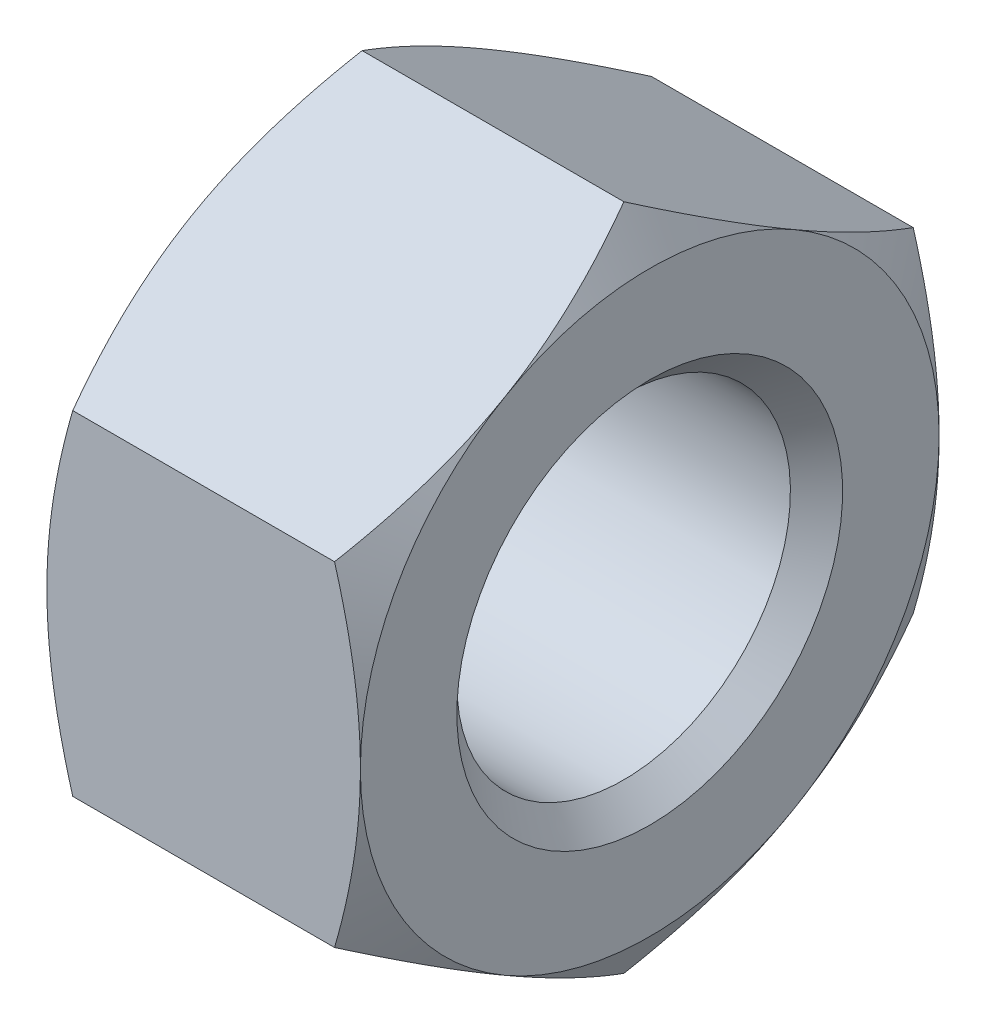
ISO-10303-21;
HEADER;
FILE_DESCRIPTION(('STEP AP214'),'2;1');
FILE_NAME('part.step','',(''),(''),'','','');
FILE_SCHEMA(('AUTOMOTIVE_DESIGN { 1 0 10303 214 1 1 1 1 }'));
ENDSEC;
DATA;
#1=APPLICATION_CONTEXT('core data for automotive mechanical design processes');
#2=APPLICATION_PROTOCOL_DEFINITION('international standard','automotive_design',2000,#1);
#3=PRODUCT_CONTEXT('',#1,'mechanical');
#4=PRODUCT('Part','Part','',(#3));
#5=PRODUCT_RELATED_PRODUCT_CATEGORY('part','',(#4));
#6=PRODUCT_DEFINITION_FORMATION('','',#4);
#7=PRODUCT_DEFINITION_CONTEXT('part definition',#1,'design');
#8=PRODUCT_DEFINITION('design','',#6,#7);
#9=PRODUCT_DEFINITION_SHAPE('','',#8);
#10=(LENGTH_UNIT() NAMED_UNIT(*) SI_UNIT(.MILLI.,.METRE.));
#11=(NAMED_UNIT(*) PLANE_ANGLE_UNIT() SI_UNIT($,.RADIAN.));
#12=(NAMED_UNIT(*) SI_UNIT($,.STERADIAN.) SOLID_ANGLE_UNIT());
#13=UNCERTAINTY_MEASURE_WITH_UNIT(LENGTH_MEASURE(1.E-05),#10,'distance_accuracy_value','');
#14=(GEOMETRIC_REPRESENTATION_CONTEXT(3) GLOBAL_UNCERTAINTY_ASSIGNED_CONTEXT((#13)) GLOBAL_UNIT_ASSIGNED_CONTEXT((#10,
#11,#12)) REPRESENTATION_CONTEXT('',''));
#15=CARTESIAN_POINT('',(0.,0.,0.));
#16=DIRECTION('',(0.,0.,1.));
#17=DIRECTION('',(1.,0.,0.));
#18=AXIS2_PLACEMENT_3D('',#15,#16,#17);
#19=DIRECTION('',(-0.707106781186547,0.707106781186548,0.));
#20=VECTOR('',#19,1.);
#21=CARTESIAN_POINT('',(0.54125,7.45875,0.));
#22=LINE('',#21,#20);
#23=CARTESIAN_POINT('',(8.,0.,0.));
#24=DIRECTION('',(-1.,0.,0.));
#25=AXIS1_PLACEMENT('',#23,#24);
#26=SURFACE_OF_REVOLUTION('',#22,#25);
#27=CARTESIAN_POINT('',(1.0825,0.,0.));
#28=DIRECTION('',(-1.,0.,0.));
#29=DIRECTION('',(0.,1.,0.));
#30=AXIS2_PLACEMENT_3D('',#27,#28,#29);
#31=CIRCLE('',#30,6.9175);
#32=CARTESIAN_POINT('',(1.0825,6.9175,0.));
#33=VERTEX_POINT('',#32);
#34=EDGE_CURVE('E323',#33,#33,#31,.T.);
#35=ORIENTED_EDGE('',*,*,#34,.F.);
#36=EDGE_LOOP('',(#35));
#37=FACE_BOUND('',#36,.T.);
#38=CARTESIAN_POINT('',(0.,0.,0.));
#39=DIRECTION('',(-1.,0.,0.));
#40=DIRECTION('',(0.,1.,0.));
#41=AXIS2_PLACEMENT_3D('',#38,#39,#40);
#42=CIRCLE('',#41,8.);
#43=CARTESIAN_POINT('',(0.,8.,0.));
#44=VERTEX_POINT('',#43);
#45=EDGE_CURVE('E136',#44,#44,#42,.T.);
#46=ORIENTED_EDGE('',*,*,#45,.T.);
#47=EDGE_LOOP('',(#46));
#48=FACE_BOUND('',#47,.T.);
#49=ADVANCED_FACE('F17',(#37,#48),#26,.F.);
#50=CARTESIAN_POINT('',(0.,10.,0.));
#51=DIRECTION('',(-1.,0.,0.));
#52=DIRECTION('',(0.,-1.,0.));
#53=AXIS2_PLACEMENT_3D('',#50,#51,#52);
#54=PLANE('',#53);
#55=CARTESIAN_POINT('',(0.,0.,0.));
#56=DIRECTION('',(-1.,0.,0.));
#57=DIRECTION('',(0.,1.,0.));
#58=AXIS2_PLACEMENT_3D('',#55,#56,#57);
#59=CIRCLE('',#58,12.);
#60=CARTESIAN_POINT('',(0.,10.3923048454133,6.));
#61=VERTEX_POINT('',#60);
#62=CARTESIAN_POINT('',(0.,10.3923048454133,-6.));
#63=VERTEX_POINT('',#62);
#64=EDGE_CURVE('E11',#61,#63,#59,.T.);
#65=ORIENTED_EDGE('',*,*,#64,.T.);
#66=CARTESIAN_POINT('',(0.,0.,0.));
#67=DIRECTION('',(-1.,0.,0.));
#68=DIRECTION('',(0.,1.,0.));
#69=AXIS2_PLACEMENT_3D('',#66,#67,#68);
#70=CIRCLE('',#69,12.);
#71=CARTESIAN_POINT('',(0.,0.,-12.));
#72=VERTEX_POINT('',#71);
#73=EDGE_CURVE('E27',#63,#72,#70,.T.);
#74=ORIENTED_EDGE('',*,*,#73,.T.);
#75=CARTESIAN_POINT('',(0.,0.,0.));
#76=DIRECTION('',(-1.,0.,0.));
#77=DIRECTION('',(0.,1.,0.));
#78=AXIS2_PLACEMENT_3D('',#75,#76,#77);
#79=CIRCLE('',#78,12.);
#80=CARTESIAN_POINT('',(0.,-10.3923048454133,-6.));
#81=VERTEX_POINT('',#80);
#82=EDGE_CURVE('E147',#72,#81,#79,.T.);
#83=ORIENTED_EDGE('',*,*,#82,.T.);
#84=CARTESIAN_POINT('',(0.,0.,0.));
#85=DIRECTION('',(-1.,0.,0.));
#86=DIRECTION('',(0.,1.,0.));
#87=AXIS2_PLACEMENT_3D('',#84,#85,#86);
#88=CIRCLE('',#87,12.);
#89=CARTESIAN_POINT('',(0.,-10.3923048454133,6.));
#90=VERTEX_POINT('',#89);
#91=EDGE_CURVE('E144',#81,#90,#88,.T.);
#92=ORIENTED_EDGE('',*,*,#91,.T.);
#93=CARTESIAN_POINT('',(0.,0.,0.));
#94=DIRECTION('',(-1.,0.,0.));
#95=DIRECTION('',(0.,1.,0.));
#96=AXIS2_PLACEMENT_3D('',#93,#94,#95);
#97=CIRCLE('',#96,12.);
#98=CARTESIAN_POINT('',(0.,0.,12.));
#99=VERTEX_POINT('',#98);
#100=EDGE_CURVE('E148',#90,#99,#97,.T.);
#101=ORIENTED_EDGE('',*,*,#100,.T.);
#102=CARTESIAN_POINT('',(0.,0.,0.));
#103=DIRECTION('',(-1.,0.,0.));
#104=DIRECTION('',(0.,1.,0.));
#105=AXIS2_PLACEMENT_3D('',#102,#103,#104);
#106=CIRCLE('',#105,12.);
#107=EDGE_CURVE('E374',#99,#61,#106,.T.);
#108=ORIENTED_EDGE('',*,*,#107,.T.);
#109=EDGE_LOOP('',(#65,#74,#83,#92,#101,#108));
#110=FACE_BOUND('',#109,.T.);
#111=ORIENTED_EDGE('',*,*,#45,.F.);
#112=EDGE_LOOP('',(#111));
#113=FACE_BOUND('',#112,.T.);
#114=ADVANCED_FACE('F196',(#110,#113),#54,.T.);
#115=CARTESIAN_POINT('',(13.,10.,0.));
#116=DIRECTION('',(1.,0.,0.));
#117=DIRECTION('',(0.,0.,-1.));
#118=AXIS2_PLACEMENT_3D('',#115,#116,#117);
#119=PLANE('',#118);
#120=CARTESIAN_POINT('',(13.,0.,0.));
#121=DIRECTION('',(-1.,0.,0.));
#122=DIRECTION('',(0.,1.,0.));
#123=AXIS2_PLACEMENT_3D('',#120,#121,#122);
#124=CIRCLE('',#123,8.);
#125=CARTESIAN_POINT('',(13.,8.,0.));
#126=VERTEX_POINT('',#125);
#127=EDGE_CURVE('E322',#126,#126,#124,.T.);
#128=ORIENTED_EDGE('',*,*,#127,.T.);
#129=EDGE_LOOP('',(#128));
#130=FACE_BOUND('',#129,.T.);
#131=CARTESIAN_POINT('',(13.,0.,0.));
#132=DIRECTION('',(-1.,0.,0.));
#133=DIRECTION('',(0.,1.,0.));
#134=AXIS2_PLACEMENT_3D('',#131,#132,#133);
#135=CIRCLE('',#134,12.);
#136=CARTESIAN_POINT('',(13.,10.3923048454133,6.));
#137=VERTEX_POINT('',#136);
#138=CARTESIAN_POINT('',(13.,10.3923048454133,-6.));
#139=VERTEX_POINT('',#138);
#140=EDGE_CURVE('E122',#137,#139,#135,.T.);
#141=ORIENTED_EDGE('',*,*,#140,.F.);
#142=CARTESIAN_POINT('',(13.,0.,0.));
#143=DIRECTION('',(-1.,0.,0.));
#144=DIRECTION('',(0.,1.,0.));
#145=AXIS2_PLACEMENT_3D('',#142,#143,#144);
#146=CIRCLE('',#145,12.);
#147=CARTESIAN_POINT('',(13.,0.,12.));
#148=VERTEX_POINT('',#147);
#149=EDGE_CURVE('E128',#148,#137,#146,.T.);
#150=ORIENTED_EDGE('',*,*,#149,.F.);
#151=CARTESIAN_POINT('',(13.,0.,0.));
#152=DIRECTION('',(-1.,0.,0.));
#153=DIRECTION('',(0.,1.,0.));
#154=AXIS2_PLACEMENT_3D('',#151,#152,#153);
#155=CIRCLE('',#154,12.);
#156=CARTESIAN_POINT('',(13.,-10.3923048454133,6.));
#157=VERTEX_POINT('',#156);
#158=EDGE_CURVE('E402',#157,#148,#155,.T.);
#159=ORIENTED_EDGE('',*,*,#158,.F.);
#160=CARTESIAN_POINT('',(13.,0.,0.));
#161=DIRECTION('',(-1.,0.,0.));
#162=DIRECTION('',(0.,1.,0.));
#163=AXIS2_PLACEMENT_3D('',#160,#161,#162);
#164=CIRCLE('',#163,12.);
#165=CARTESIAN_POINT('',(13.,-10.3923048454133,-6.));
#166=VERTEX_POINT('',#165);
#167=EDGE_CURVE('E168',#166,#157,#164,.T.);
#168=ORIENTED_EDGE('',*,*,#167,.F.);
#169=CARTESIAN_POINT('',(13.,0.,0.));
#170=DIRECTION('',(-1.,0.,0.));
#171=DIRECTION('',(0.,1.,0.));
#172=AXIS2_PLACEMENT_3D('',#169,#170,#171);
#173=CIRCLE('',#172,12.);
#174=CARTESIAN_POINT('',(13.,0.,-12.));
#175=VERTEX_POINT('',#174);
#176=EDGE_CURVE('E155',#175,#166,#173,.T.);
#177=ORIENTED_EDGE('',*,*,#176,.F.);
#178=CARTESIAN_POINT('',(13.,0.,0.));
#179=DIRECTION('',(-1.,0.,0.));
#180=DIRECTION('',(0.,1.,0.));
#181=AXIS2_PLACEMENT_3D('',#178,#179,#180);
#182=CIRCLE('',#181,12.);
#183=EDGE_CURVE('E185',#139,#175,#182,.T.);
#184=ORIENTED_EDGE('',*,*,#183,.F.);
#185=EDGE_LOOP('',(#141,#150,#159,#168,#177,#184));
#186=FACE_BOUND('',#185,.T.);
#187=ADVANCED_FACE('F200',(#130,#186),#119,.T.);
#188=DIRECTION('',(0.707106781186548,0.707106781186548,0.));
#189=VECTOR('',#188,1.);
#190=CARTESIAN_POINT('',(12.45875,7.45875,0.));
#191=LINE('',#190,#189);
#192=CARTESIAN_POINT('',(5.,0.,0.));
#193=DIRECTION('',(1.,0.,0.));
#194=AXIS1_PLACEMENT('',#192,#193);
#195=SURFACE_OF_REVOLUTION('',#191,#194);
#196=ORIENTED_EDGE('',*,*,#127,.F.);
#197=EDGE_LOOP('',(#196));
#198=FACE_BOUND('',#197,.T.);
#199=CARTESIAN_POINT('',(11.9175,0.,0.));
#200=DIRECTION('',(-1.,0.,0.));
#201=DIRECTION('',(0.,1.,0.));
#202=AXIS2_PLACEMENT_3D('',#199,#200,#201);
#203=CIRCLE('',#202,6.9175);
#204=CARTESIAN_POINT('',(11.9175,6.9175,0.));
#205=VERTEX_POINT('',#204);
#206=EDGE_CURVE('E316',#205,#205,#203,.T.);
#207=ORIENTED_EDGE('',*,*,#206,.T.);
#208=EDGE_LOOP('',(#207));
#209=FACE_BOUND('',#208,.T.);
#210=ADVANCED_FACE('F204',(#198,#209),#195,.F.);
#211=CARTESIAN_POINT('',(6.5,0.,0.));
#212=DIRECTION('',(1.,0.,0.));
#213=DIRECTION('',(0.,1.,0.));
#214=AXIS2_PLACEMENT_3D('',#211,#212,#213);
#215=CIRCLE('',#214,6.9175);
#216=DIRECTION('',(-1.,0.,0.));
#217=VECTOR('',#216,1.);
#218=SURFACE_OF_LINEAR_EXTRUSION('',#215,#217);
#219=ORIENTED_EDGE('',*,*,#206,.F.);
#220=EDGE_LOOP('',(#219));
#221=FACE_BOUND('',#220,.T.);
#222=ORIENTED_EDGE('',*,*,#34,.T.);
#223=EDGE_LOOP('',(#222));
#224=FACE_BOUND('',#223,.T.);
#225=ADVANCED_FACE('F208',(#221,#224),#218,.T.);
#226=DIRECTION('',(0.5,-0.866025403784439,0.));
#227=VECTOR('',#226,1.);
#228=CARTESIAN_POINT('',(9.75,17.6291651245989,0.));
#229=LINE('',#228,#227);
#230=CARTESIAN_POINT('',(19.9282032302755,0.,0.));
#231=DIRECTION('',(-1.,0.,0.));
#232=AXIS1_PLACEMENT('',#230,#231);
#233=SURFACE_OF_REVOLUTION('',#229,#232);
#234=CARTESIAN_POINT('',(13.,10.3923048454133,6.));
#235=CARTESIAN_POINT('',(13.,8.78460969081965,8.78460969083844));
#236=CARTESIAN_POINT('',(11.9282032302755,6.92820323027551,12.));
#237=(BOUNDED_CURVE() B_SPLINE_CURVE(2,(#234,#235,#236),.UNSPECIFIED.,.F.,
.F.) B_SPLINE_CURVE_WITH_KNOTS((3,3),(21.0892336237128,30.0861811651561),
.UNSPECIFIED.) CURVE() GEOMETRIC_REPRESENTATION_ITEM() RATIONAL_B_SPLINE_CURVE((1.,
1.09046896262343,1.10374739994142)) REPRESENTATION_ITEM(''));
#238=CARTESIAN_POINT('',(11.9282032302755,6.92820323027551,12.));
#239=VERTEX_POINT('',#238);
#240=EDGE_CURVE('E118',#137,#239,#237,.T.);
#241=ORIENTED_EDGE('',*,*,#240,.T.);
#242=CARTESIAN_POINT('',(11.9282032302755,6.92820323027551,12.));
#243=CARTESIAN_POINT('',(13.,3.21539030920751,12.));
#244=CARTESIAN_POINT('',(13.,0.,12.));
#245=(BOUNDED_CURVE() B_SPLINE_CURVE(2,(#242,#243,#244),.UNSPECIFIED.,.F.,
.F.) B_SPLINE_CURVE_WITH_KNOTS((3,3),(12.0922860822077,21.0892336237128),
.UNSPECIFIED.) CURVE() GEOMETRIC_REPRESENTATION_ITEM() RATIONAL_B_SPLINE_CURVE((1.1037473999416,
1.09046896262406,1.)) REPRESENTATION_ITEM(''));
#246=EDGE_CURVE('E389',#239,#148,#245,.T.);
#247=ORIENTED_EDGE('',*,*,#246,.T.);
#248=ORIENTED_EDGE('',*,*,#149,.T.);
#249=EDGE_LOOP('',(#241,#247,#248));
#250=FACE_BOUND('',#249,.T.);
#251=ADVANCED_FACE('F212',(#250),#233,.F.);
#252=DIRECTION('',(0.5,-0.866025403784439,0.));
#253=VECTOR('',#252,1.);
#254=CARTESIAN_POINT('',(9.75,17.6291651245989,0.));
#255=LINE('',#254,#253);
#256=CARTESIAN_POINT('',(19.9282032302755,0.,0.));
#257=DIRECTION('',(-1.,0.,0.));
#258=AXIS1_PLACEMENT('',#256,#257);
#259=SURFACE_OF_REVOLUTION('',#255,#258);
#260=CARTESIAN_POINT('',(13.,10.3923048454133,-6.));
#261=CARTESIAN_POINT('',(13.,12.0000000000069,-3.21539030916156));
#262=CARTESIAN_POINT('',(11.9282032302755,13.856406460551,0.));
#263=(BOUNDED_CURVE() B_SPLINE_CURVE(2,(#260,#261,#262),.UNSPECIFIED.,.F.,
.F.) B_SPLINE_CURVE_WITH_KNOTS((3,3),(21.0892336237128,30.0861811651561),
.UNSPECIFIED.) CURVE() GEOMETRIC_REPRESENTATION_ITEM() RATIONAL_B_SPLINE_CURVE((1.,
1.09046896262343,1.10374739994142)) REPRESENTATION_ITEM(''));
#264=CARTESIAN_POINT('',(11.9282032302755,13.856406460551,0.));
#265=VERTEX_POINT('',#264);
#266=EDGE_CURVE('E121',#139,#265,#263,.T.);
#267=ORIENTED_EDGE('',*,*,#266,.T.);
#268=CARTESIAN_POINT('',(11.9282032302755,13.856406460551,0.));
#269=CARTESIAN_POINT('',(13.,12.000000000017,3.21539030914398));
#270=CARTESIAN_POINT('',(13.,10.3923048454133,6.));
#271=(BOUNDED_CURVE() B_SPLINE_CURVE(2,(#268,#269,#270),.UNSPECIFIED.,.F.,
.F.) B_SPLINE_CURVE_WITH_KNOTS((3,3),(12.0922860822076,21.0892336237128),
.UNSPECIFIED.) CURVE() GEOMETRIC_REPRESENTATION_ITEM() RATIONAL_B_SPLINE_CURVE((1.10374739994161,
1.09046896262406,1.)) REPRESENTATION_ITEM(''));
#272=EDGE_CURVE('E111',#265,#137,#271,.T.);
#273=ORIENTED_EDGE('',*,*,#272,.T.);
#274=ORIENTED_EDGE('',*,*,#140,.T.);
#275=EDGE_LOOP('',(#267,#273,#274));
#276=FACE_BOUND('',#275,.T.);
#277=ADVANCED_FACE('F125',(#276),#259,.F.);
#278=DIRECTION('',(0.5,-0.866025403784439,0.));
#279=VECTOR('',#278,1.);
#280=CARTESIAN_POINT('',(9.75,17.6291651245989,0.));
#281=LINE('',#280,#279);
#282=CARTESIAN_POINT('',(19.9282032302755,0.,0.));
#283=DIRECTION('',(-1.,0.,0.));
#284=AXIS1_PLACEMENT('',#282,#283);
#285=SURFACE_OF_REVOLUTION('',#281,#284);
#286=CARTESIAN_POINT('',(13.,0.,-12.));
#287=CARTESIAN_POINT('',(13.,3.21539030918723,-12.));
#288=CARTESIAN_POINT('',(11.9282032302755,6.92820323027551,-12.));
#289=(BOUNDED_CURVE() B_SPLINE_CURVE(2,(#286,#287,#288),.UNSPECIFIED.,.F.,
.F.) B_SPLINE_CURVE_WITH_KNOTS((3,3),(21.0892336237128,30.0861811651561),
.UNSPECIFIED.) CURVE() GEOMETRIC_REPRESENTATION_ITEM() RATIONAL_B_SPLINE_CURVE((1.,
1.09046896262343,1.10374739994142)) REPRESENTATION_ITEM(''));
#290=CARTESIAN_POINT('',(11.9282032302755,6.92820323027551,-12.));
#291=VERTEX_POINT('',#290);
#292=EDGE_CURVE('E149',#175,#291,#289,.T.);
#293=ORIENTED_EDGE('',*,*,#292,.T.);
#294=CARTESIAN_POINT('',(11.9282032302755,6.92820323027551,-12.));
#295=CARTESIAN_POINT('',(13.,8.78460969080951,-8.78460969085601));
#296=CARTESIAN_POINT('',(13.,10.3923048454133,-6.));
#297=(BOUNDED_CURVE() B_SPLINE_CURVE(2,(#294,#295,#296),.UNSPECIFIED.,.F.,
.F.) B_SPLINE_CURVE_WITH_KNOTS((3,3),(12.0922860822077,21.0892336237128),
.UNSPECIFIED.) CURVE() GEOMETRIC_REPRESENTATION_ITEM() RATIONAL_B_SPLINE_CURVE((1.1037473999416,
1.09046896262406,1.)) REPRESENTATION_ITEM(''));
#298=EDGE_CURVE('E154',#291,#139,#297,.T.);
#299=ORIENTED_EDGE('',*,*,#298,.T.);
#300=ORIENTED_EDGE('',*,*,#183,.T.);
#301=EDGE_LOOP('',(#293,#299,#300));
#302=FACE_BOUND('',#301,.T.);
#303=ADVANCED_FACE('F225',(#302),#285,.F.);
#304=DIRECTION('',(0.5,-0.866025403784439,0.));
#305=VECTOR('',#304,1.);
#306=CARTESIAN_POINT('',(9.75,17.6291651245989,0.));
#307=LINE('',#306,#305);
#308=CARTESIAN_POINT('',(19.9282032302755,0.,0.));
#309=DIRECTION('',(-1.,0.,0.));
#310=AXIS1_PLACEMENT('',#308,#309);
#311=SURFACE_OF_REVOLUTION('',#307,#310);
#312=CARTESIAN_POINT('',(11.9282032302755,-6.92820323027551,-12.));
#313=CARTESIAN_POINT('',(13.,-3.21539030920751,-12.));
#314=CARTESIAN_POINT('',(13.,0.,-12.));
#315=(BOUNDED_CURVE() B_SPLINE_CURVE(2,(#312,#313,#314),.UNSPECIFIED.,.F.,
.F.) B_SPLINE_CURVE_WITH_KNOTS((3,3),(12.0922860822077,21.0892336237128),
.UNSPECIFIED.) CURVE() GEOMETRIC_REPRESENTATION_ITEM() RATIONAL_B_SPLINE_CURVE((1.1037473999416,
1.09046896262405,1.)) REPRESENTATION_ITEM(''));
#316=CARTESIAN_POINT('',(11.9282032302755,-6.92820323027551,-12.));
#317=VERTEX_POINT('',#316);
#318=EDGE_CURVE('E161',#317,#175,#315,.T.);
#319=ORIENTED_EDGE('',*,*,#318,.T.);
#320=ORIENTED_EDGE('',*,*,#176,.T.);
#321=CARTESIAN_POINT('',(13.,-10.3923048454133,-6.));
#322=CARTESIAN_POINT('',(13.,-8.78460969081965,-8.78460969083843));
#323=CARTESIAN_POINT('',(11.9282032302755,-6.92820323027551,-12.));
#324=(BOUNDED_CURVE() B_SPLINE_CURVE(2,(#321,#322,#323),.UNSPECIFIED.,.F.,
.F.) B_SPLINE_CURVE_WITH_KNOTS((3,3),(21.0892336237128,30.0861811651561),
.UNSPECIFIED.) CURVE() GEOMETRIC_REPRESENTATION_ITEM() RATIONAL_B_SPLINE_CURVE((1.,
1.09046896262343,1.10374739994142)) REPRESENTATION_ITEM(''));
#325=EDGE_CURVE('E162',#166,#317,#324,.T.);
#326=ORIENTED_EDGE('',*,*,#325,.T.);
#327=EDGE_LOOP('',(#319,#320,#326));
#328=FACE_BOUND('',#327,.T.);
#329=ADVANCED_FACE('F228',(#328),#311,.F.);
#330=DIRECTION('',(0.5,-0.866025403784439,0.));
#331=VECTOR('',#330,1.);
#332=CARTESIAN_POINT('',(9.75,17.6291651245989,0.));
#333=LINE('',#332,#331);
#334=CARTESIAN_POINT('',(19.9282032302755,0.,0.));
#335=DIRECTION('',(-1.,0.,0.));
#336=AXIS1_PLACEMENT('',#334,#335);
#337=SURFACE_OF_REVOLUTION('',#333,#336);
#338=CARTESIAN_POINT('',(11.9282032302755,-13.856406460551,0.));
#339=CARTESIAN_POINT('',(13.,-12.000000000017,-3.21539030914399));
#340=CARTESIAN_POINT('',(13.,-10.3923048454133,-6.));
#341=(BOUNDED_CURVE() B_SPLINE_CURVE(2,(#338,#339,#340),.UNSPECIFIED.,.F.,
.F.) B_SPLINE_CURVE_WITH_KNOTS((3,3),(12.0922860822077,21.0892336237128),
.UNSPECIFIED.) CURVE() GEOMETRIC_REPRESENTATION_ITEM() RATIONAL_B_SPLINE_CURVE((1.10374739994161,
1.09046896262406,1.)) REPRESENTATION_ITEM(''));
#342=CARTESIAN_POINT('',(11.9282032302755,-13.856406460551,0.));
#343=VERTEX_POINT('',#342);
#344=EDGE_CURVE('E163',#343,#166,#341,.T.);
#345=ORIENTED_EDGE('',*,*,#344,.T.);
#346=ORIENTED_EDGE('',*,*,#167,.T.);
#347=CARTESIAN_POINT('',(13.,-10.3923048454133,6.));
#348=CARTESIAN_POINT('',(13.,-12.0000000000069,3.21539030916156));
#349=CARTESIAN_POINT('',(11.9282032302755,-13.856406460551,0.));
#350=(BOUNDED_CURVE() B_SPLINE_CURVE(2,(#347,#348,#349),.UNSPECIFIED.,.F.,
.F.) B_SPLINE_CURVE_WITH_KNOTS((3,3),(21.0892336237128,30.0861811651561),
.UNSPECIFIED.) CURVE() GEOMETRIC_REPRESENTATION_ITEM() RATIONAL_B_SPLINE_CURVE((1.,
1.09046896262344,1.10374739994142)) REPRESENTATION_ITEM(''));
#351=EDGE_CURVE('E418',#157,#343,#350,.T.);
#352=ORIENTED_EDGE('',*,*,#351,.T.);
#353=EDGE_LOOP('',(#345,#346,#352));
#354=FACE_BOUND('',#353,.T.);
#355=ADVANCED_FACE('F232',(#354),#337,.F.);
#356=DIRECTION('',(0.5,-0.866025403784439,0.));
#357=VECTOR('',#356,1.);
#358=CARTESIAN_POINT('',(9.75,17.6291651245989,0.));
#359=LINE('',#358,#357);
#360=CARTESIAN_POINT('',(19.9282032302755,0.,0.));
#361=DIRECTION('',(-1.,0.,0.));
#362=AXIS1_PLACEMENT('',#360,#361);
#363=SURFACE_OF_REVOLUTION('',#359,#362);
#364=CARTESIAN_POINT('',(11.9282032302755,-6.92820323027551,12.));
#365=CARTESIAN_POINT('',(13.,-8.7846096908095,8.78460969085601));
#366=CARTESIAN_POINT('',(13.,-10.3923048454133,6.));
#367=(BOUNDED_CURVE() B_SPLINE_CURVE(2,(#364,#365,#366),.UNSPECIFIED.,.F.,
.F.) B_SPLINE_CURVE_WITH_KNOTS((3,3),(12.0922860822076,21.0892336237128),
.UNSPECIFIED.) CURVE() GEOMETRIC_REPRESENTATION_ITEM() RATIONAL_B_SPLINE_CURVE((1.10374739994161,
1.09046896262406,1.)) REPRESENTATION_ITEM(''));
#368=CARTESIAN_POINT('',(11.9282032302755,-6.92820323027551,12.));
#369=VERTEX_POINT('',#368);
#370=EDGE_CURVE('E353',#369,#157,#367,.T.);
#371=ORIENTED_EDGE('',*,*,#370,.T.);
#372=ORIENTED_EDGE('',*,*,#158,.T.);
#373=CARTESIAN_POINT('',(13.,0.,12.));
#374=CARTESIAN_POINT('',(13.,-3.21539030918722,12.));
#375=CARTESIAN_POINT('',(11.9282032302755,-6.92820323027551,12.));
#376=(BOUNDED_CURVE() B_SPLINE_CURVE(2,(#373,#374,#375),.UNSPECIFIED.,.F.,
.F.) B_SPLINE_CURVE_WITH_KNOTS((3,3),(21.0892336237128,30.0861811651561),
.UNSPECIFIED.) CURVE() GEOMETRIC_REPRESENTATION_ITEM() RATIONAL_B_SPLINE_CURVE((1.,
1.09046896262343,1.10374739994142)) REPRESENTATION_ITEM(''));
#377=EDGE_CURVE('E377',#148,#369,#376,.T.);
#378=ORIENTED_EDGE('',*,*,#377,.T.);
#379=EDGE_LOOP('',(#371,#372,#378));
#380=FACE_BOUND('',#379,.T.);
#381=ADVANCED_FACE('F243',(#380),#363,.F.);
#382=DIRECTION('',(-0.5,-0.866025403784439,0.));
#383=VECTOR('',#382,1.);
#384=CARTESIAN_POINT('',(3.25,17.6291651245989,0.));
#385=LINE('',#384,#383);
#386=CARTESIAN_POINT('',(-6.92820323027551,0.,0.));
#387=DIRECTION('',(1.,0.,0.));
#388=AXIS1_PLACEMENT('',#386,#387);
#389=SURFACE_OF_REVOLUTION('',#385,#388);
#390=CARTESIAN_POINT('',(0.,10.3923048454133,6.));
#391=CARTESIAN_POINT('',(0.,12.0000000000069,3.21539030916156));
#392=CARTESIAN_POINT('',(1.07179676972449,13.856406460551,0.));
#393=(BOUNDED_CURVE() B_SPLINE_CURVE(2,(#390,#391,#392),.UNSPECIFIED.,.F.,
.F.) B_SPLINE_CURVE_WITH_KNOTS((3,3),(21.0892336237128,30.0861811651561),
.UNSPECIFIED.) CURVE() GEOMETRIC_REPRESENTATION_ITEM() RATIONAL_B_SPLINE_CURVE((1.,
1.09046896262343,1.10374739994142)) REPRESENTATION_ITEM(''));
#394=CARTESIAN_POINT('',(1.07179676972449,13.856406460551,0.));
#395=VERTEX_POINT('',#394);
#396=EDGE_CURVE('E139',#61,#395,#393,.T.);
#397=ORIENTED_EDGE('',*,*,#396,.T.);
#398=CARTESIAN_POINT('',(1.07179676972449,13.856406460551,0.));
#399=CARTESIAN_POINT('',(0.,12.000000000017,-3.21539030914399));
#400=CARTESIAN_POINT('',(0.,10.3923048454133,-6.));
#401=(BOUNDED_CURVE() B_SPLINE_CURVE(2,(#398,#399,#400),.UNSPECIFIED.,.F.,
.F.) B_SPLINE_CURVE_WITH_KNOTS((3,3),(12.0922860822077,21.0892336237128),
.UNSPECIFIED.) CURVE() GEOMETRIC_REPRESENTATION_ITEM() RATIONAL_B_SPLINE_CURVE((1.10374739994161,
1.09046896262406,1.)) REPRESENTATION_ITEM(''));
#402=EDGE_CURVE('E93',#395,#63,#401,.T.);
#403=ORIENTED_EDGE('',*,*,#402,.T.);
#404=ORIENTED_EDGE('',*,*,#64,.F.);
#405=EDGE_LOOP('',(#397,#403,#404));
#406=FACE_BOUND('',#405,.T.);
#407=ADVANCED_FACE('F246',(#406),#389,.F.);
#408=DIRECTION('',(-0.5,-0.866025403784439,0.));
#409=VECTOR('',#408,1.);
#410=CARTESIAN_POINT('',(3.25,17.6291651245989,0.));
#411=LINE('',#410,#409);
#412=CARTESIAN_POINT('',(-6.92820323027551,0.,0.));
#413=DIRECTION('',(1.,0.,0.));
#414=AXIS1_PLACEMENT('',#412,#413);
#415=SURFACE_OF_REVOLUTION('',#411,#414);
#416=CARTESIAN_POINT('',(0.,0.,12.));
#417=CARTESIAN_POINT('',(0.,3.21539030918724,12.));
#418=CARTESIAN_POINT('',(1.07179676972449,6.92820323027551,12.));
#419=(BOUNDED_CURVE() B_SPLINE_CURVE(2,(#416,#417,#418),.UNSPECIFIED.,.F.,
.F.) B_SPLINE_CURVE_WITH_KNOTS((3,3),(21.0892336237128,30.0861811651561),
.UNSPECIFIED.) CURVE() GEOMETRIC_REPRESENTATION_ITEM() RATIONAL_B_SPLINE_CURVE((1.,
1.09046896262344,1.10374739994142)) REPRESENTATION_ITEM(''));
#420=CARTESIAN_POINT('',(1.07179676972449,6.92820323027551,12.));
#421=VERTEX_POINT('',#420);
#422=EDGE_CURVE('E375',#99,#421,#419,.T.);
#423=ORIENTED_EDGE('',*,*,#422,.T.);
#424=CARTESIAN_POINT('',(1.07179676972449,6.92820323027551,12.));
#425=CARTESIAN_POINT('',(0.,8.78460969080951,8.78460969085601));
#426=CARTESIAN_POINT('',(0.,10.3923048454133,6.));
#427=(BOUNDED_CURVE() B_SPLINE_CURVE(2,(#424,#425,#426),.UNSPECIFIED.,.F.,
.F.) B_SPLINE_CURVE_WITH_KNOTS((3,3),(12.0922860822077,21.0892336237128),
.UNSPECIFIED.) CURVE() GEOMETRIC_REPRESENTATION_ITEM() RATIONAL_B_SPLINE_CURVE((1.1037473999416,
1.09046896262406,1.)) REPRESENTATION_ITEM(''));
#428=EDGE_CURVE('E338',#421,#61,#427,.T.);
#429=ORIENTED_EDGE('',*,*,#428,.T.);
#430=ORIENTED_EDGE('',*,*,#107,.F.);
#431=EDGE_LOOP('',(#423,#429,#430));
#432=FACE_BOUND('',#431,.T.);
#433=ADVANCED_FACE('F250',(#432),#415,.F.);
#434=DIRECTION('',(-0.5,-0.866025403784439,0.));
#435=VECTOR('',#434,1.);
#436=CARTESIAN_POINT('',(3.25,17.6291651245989,0.));
#437=LINE('',#436,#435);
#438=CARTESIAN_POINT('',(-6.92820323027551,0.,0.));
#439=DIRECTION('',(1.,0.,0.));
#440=AXIS1_PLACEMENT('',#438,#439);
#441=SURFACE_OF_REVOLUTION('',#437,#440);
#442=CARTESIAN_POINT('',(0.,-10.3923048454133,6.));
#443=CARTESIAN_POINT('',(0.,-8.78460969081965,8.78460969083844));
#444=CARTESIAN_POINT('',(1.07179676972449,-6.92820323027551,12.));
#445=(BOUNDED_CURVE() B_SPLINE_CURVE(2,(#442,#443,#444),.UNSPECIFIED.,.F.,
.F.) B_SPLINE_CURVE_WITH_KNOTS((3,3),(21.0892336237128,30.0861811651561),
.UNSPECIFIED.) CURVE() GEOMETRIC_REPRESENTATION_ITEM() RATIONAL_B_SPLINE_CURVE((1.,
1.09046896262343,1.10374739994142)) REPRESENTATION_ITEM(''));
#446=CARTESIAN_POINT('',(1.07179676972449,-6.92820323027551,12.));
#447=VERTEX_POINT('',#446);
#448=EDGE_CURVE('E302',#90,#447,#445,.T.);
#449=ORIENTED_EDGE('',*,*,#448,.T.);
#450=CARTESIAN_POINT('',(1.07179676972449,-6.92820323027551,12.));
#451=CARTESIAN_POINT('',(0.,-3.21539030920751,12.));
#452=CARTESIAN_POINT('',(0.,0.,12.));
#453=(BOUNDED_CURVE() B_SPLINE_CURVE(2,(#450,#451,#452),.UNSPECIFIED.,.F.,
.F.) B_SPLINE_CURVE_WITH_KNOTS((3,3),(12.0922860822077,21.0892336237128),
.UNSPECIFIED.) CURVE() GEOMETRIC_REPRESENTATION_ITEM() RATIONAL_B_SPLINE_CURVE((1.1037473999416,
1.09046896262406,1.)) REPRESENTATION_ITEM(''));
#454=EDGE_CURVE('E306',#447,#99,#453,.T.);
#455=ORIENTED_EDGE('',*,*,#454,.T.);
#456=ORIENTED_EDGE('',*,*,#100,.F.);
#457=EDGE_LOOP('',(#449,#455,#456));
#458=FACE_BOUND('',#457,.T.);
#459=ADVANCED_FACE('F254',(#458),#441,.F.);
#460=DIRECTION('',(-0.5,-0.866025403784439,0.));
#461=VECTOR('',#460,1.);
#462=CARTESIAN_POINT('',(3.25,17.6291651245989,0.));
#463=LINE('',#462,#461);
#464=CARTESIAN_POINT('',(-6.92820323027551,0.,0.));
#465=DIRECTION('',(1.,0.,0.));
#466=AXIS1_PLACEMENT('',#464,#465);
#467=SURFACE_OF_REVOLUTION('',#463,#466);
#468=CARTESIAN_POINT('',(1.07179676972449,-13.856406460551,0.));
#469=CARTESIAN_POINT('',(0.,-12.000000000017,3.21539030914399));
#470=CARTESIAN_POINT('',(0.,-10.3923048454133,6.));
#471=(BOUNDED_CURVE() B_SPLINE_CURVE(2,(#468,#469,#470),.UNSPECIFIED.,.F.,
.F.) B_SPLINE_CURVE_WITH_KNOTS((3,3),(12.0922860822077,21.0892336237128),
.UNSPECIFIED.) CURVE() GEOMETRIC_REPRESENTATION_ITEM() RATIONAL_B_SPLINE_CURVE((1.1037473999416,
1.09046896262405,1.)) REPRESENTATION_ITEM(''));
#472=CARTESIAN_POINT('',(1.07179676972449,-13.856406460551,0.));
#473=VERTEX_POINT('',#472);
#474=EDGE_CURVE('E297',#473,#90,#471,.T.);
#475=ORIENTED_EDGE('',*,*,#474,.T.);
#476=ORIENTED_EDGE('',*,*,#91,.F.);
#477=CARTESIAN_POINT('',(0.,-10.3923048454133,-6.));
#478=CARTESIAN_POINT('',(0.,-12.0000000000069,-3.21539030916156));
#479=CARTESIAN_POINT('',(1.07179676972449,-13.856406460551,0.));
#480=(BOUNDED_CURVE() B_SPLINE_CURVE(2,(#477,#478,#479),.UNSPECIFIED.,.F.,
.F.) B_SPLINE_CURVE_WITH_KNOTS((3,3),(21.0892336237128,30.0861811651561),
.UNSPECIFIED.) CURVE() GEOMETRIC_REPRESENTATION_ITEM() RATIONAL_B_SPLINE_CURVE((1.,
1.09046896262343,1.10374739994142)) REPRESENTATION_ITEM(''));
#481=EDGE_CURVE('E307',#81,#473,#480,.T.);
#482=ORIENTED_EDGE('',*,*,#481,.T.);
#483=EDGE_LOOP('',(#475,#476,#482));
#484=FACE_BOUND('',#483,.T.);
#485=ADVANCED_FACE('F263',(#484),#467,.F.);
#486=DIRECTION('',(-0.5,-0.866025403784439,0.));
#487=VECTOR('',#486,1.);
#488=CARTESIAN_POINT('',(3.25,17.6291651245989,0.));
#489=LINE('',#488,#487);
#490=CARTESIAN_POINT('',(-6.92820323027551,0.,0.));
#491=DIRECTION('',(1.,0.,0.));
#492=AXIS1_PLACEMENT('',#490,#491);
#493=SURFACE_OF_REVOLUTION('',#489,#492);
#494=CARTESIAN_POINT('',(1.07179676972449,-6.92820323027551,-12.));
#495=CARTESIAN_POINT('',(0.,-8.78460969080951,-8.78460969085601));
#496=CARTESIAN_POINT('',(0.,-10.3923048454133,-6.));
#497=(BOUNDED_CURVE() B_SPLINE_CURVE(2,(#494,#495,#496),.UNSPECIFIED.,.F.,
.F.) B_SPLINE_CURVE_WITH_KNOTS((3,3),(12.0922860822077,21.0892336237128),
.UNSPECIFIED.) CURVE() GEOMETRIC_REPRESENTATION_ITEM() RATIONAL_B_SPLINE_CURVE((1.1037473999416,
1.09046896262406,1.)) REPRESENTATION_ITEM(''));
#498=CARTESIAN_POINT('',(1.07179676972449,-6.92820323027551,-12.));
#499=VERTEX_POINT('',#498);
#500=EDGE_CURVE('E177',#499,#81,#497,.T.);
#501=ORIENTED_EDGE('',*,*,#500,.T.);
#502=ORIENTED_EDGE('',*,*,#82,.F.);
#503=CARTESIAN_POINT('',(0.,0.,-12.));
#504=CARTESIAN_POINT('',(0.,-3.21539030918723,-12.));
#505=CARTESIAN_POINT('',(1.07179676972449,-6.92820323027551,-12.));
#506=(BOUNDED_CURVE() B_SPLINE_CURVE(2,(#503,#504,#505),.UNSPECIFIED.,.F.,
.F.) B_SPLINE_CURVE_WITH_KNOTS((3,3),(21.0892336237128,30.0861811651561),
.UNSPECIFIED.) CURVE() GEOMETRIC_REPRESENTATION_ITEM() RATIONAL_B_SPLINE_CURVE((1.,
1.09046896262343,1.10374739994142)) REPRESENTATION_ITEM(''));
#507=EDGE_CURVE('E169',#72,#499,#506,.T.);
#508=ORIENTED_EDGE('',*,*,#507,.T.);
#509=EDGE_LOOP('',(#501,#502,#508));
#510=FACE_BOUND('',#509,.T.);
#511=ADVANCED_FACE('F266',(#510),#493,.F.);
#512=DIRECTION('',(-0.5,-0.866025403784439,0.));
#513=VECTOR('',#512,1.);
#514=CARTESIAN_POINT('',(3.25,17.6291651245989,0.));
#515=LINE('',#514,#513);
#516=CARTESIAN_POINT('',(-6.92820323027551,0.,0.));
#517=DIRECTION('',(1.,0.,0.));
#518=AXIS1_PLACEMENT('',#516,#517);
#519=SURFACE_OF_REVOLUTION('',#515,#518);
#520=CARTESIAN_POINT('',(1.07179676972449,6.92820323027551,-12.));
#521=CARTESIAN_POINT('',(0.,3.21539030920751,-12.));
#522=CARTESIAN_POINT('',(0.,0.,-12.));
#523=(BOUNDED_CURVE() B_SPLINE_CURVE(2,(#520,#521,#522),.UNSPECIFIED.,.F.,
.F.) B_SPLINE_CURVE_WITH_KNOTS((3,3),(12.0922860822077,21.0892336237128),
.UNSPECIFIED.) CURVE() GEOMETRIC_REPRESENTATION_ITEM() RATIONAL_B_SPLINE_CURVE((1.1037473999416,
1.09046896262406,1.)) REPRESENTATION_ITEM(''));
#524=CARTESIAN_POINT('',(1.07179676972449,6.92820323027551,-12.));
#525=VERTEX_POINT('',#524);
#526=EDGE_CURVE('E178',#525,#72,#523,.T.);
#527=ORIENTED_EDGE('',*,*,#526,.T.);
#528=ORIENTED_EDGE('',*,*,#73,.F.);
#529=CARTESIAN_POINT('',(0.,10.3923048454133,-6.));
#530=CARTESIAN_POINT('',(0.,8.78460969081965,-8.78460969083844));
#531=CARTESIAN_POINT('',(1.07179676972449,6.92820323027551,-12.));
#532=(BOUNDED_CURVE() B_SPLINE_CURVE(2,(#529,#530,#531),.UNSPECIFIED.,.F.,
.F.) B_SPLINE_CURVE_WITH_KNOTS((3,3),(21.0892336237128,30.0861811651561),
.UNSPECIFIED.) CURVE() GEOMETRIC_REPRESENTATION_ITEM() RATIONAL_B_SPLINE_CURVE((1.,
1.09046896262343,1.10374739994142)) REPRESENTATION_ITEM(''));
#533=EDGE_CURVE('E36',#63,#525,#532,.T.);
#534=ORIENTED_EDGE('',*,*,#533,.T.);
#535=EDGE_LOOP('',(#527,#528,#534));
#536=FACE_BOUND('',#535,.T.);
#537=ADVANCED_FACE('F270',(#536),#519,.F.);
#538=CARTESIAN_POINT('',(14.,-6.92820323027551,-12.));
#539=DIRECTION('',(0.,-0.866025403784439,-0.5));
#540=DIRECTION('',(0.,0.5,-0.866025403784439));
#541=AXIS2_PLACEMENT_3D('',#538,#539,#540);
#542=PLANE('',#541);
#543=ORIENTED_EDGE('',*,*,#481,.F.);
#544=ORIENTED_EDGE('',*,*,#500,.F.);
#545=DIRECTION('',(-1.,0.,0.));
#546=VECTOR('',#545,1.);
#547=CARTESIAN_POINT('',(14.,-6.92820323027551,-12.));
#548=LINE('',#547,#546);
#549=EDGE_CURVE('E357',#317,#499,#548,.T.);
#550=ORIENTED_EDGE('',*,*,#549,.F.);
#551=ORIENTED_EDGE('',*,*,#325,.F.);
#552=ORIENTED_EDGE('',*,*,#344,.F.);
#553=DIRECTION('',(-1.,0.,0.));
#554=VECTOR('',#553,1.);
#555=CARTESIAN_POINT('',(14.,-13.856406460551,0.));
#556=LINE('',#555,#554);
#557=EDGE_CURVE('E299',#343,#473,#556,.T.);
#558=ORIENTED_EDGE('',*,*,#557,.T.);
#559=EDGE_LOOP('',(#543,#544,#550,#551,#552,#558));
#560=FACE_BOUND('',#559,.T.);
#561=ADVANCED_FACE('F274',(#560),#542,.T.);
#562=CARTESIAN_POINT('',(14.,6.92820323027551,-12.));
#563=DIRECTION('',(0.,0.,-1.));
#564=DIRECTION('',(-1.,0.,0.));
#565=AXIS2_PLACEMENT_3D('',#562,#563,#564);
#566=PLANE('',#565);
#567=ORIENTED_EDGE('',*,*,#507,.F.);
#568=ORIENTED_EDGE('',*,*,#526,.F.);
#569=DIRECTION('',(-1.,0.,0.));
#570=VECTOR('',#569,1.);
#571=CARTESIAN_POINT('',(14.,6.92820323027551,-12.));
#572=LINE('',#571,#570);
#573=EDGE_CURVE('E134',#291,#525,#572,.T.);
#574=ORIENTED_EDGE('',*,*,#573,.F.);
#575=ORIENTED_EDGE('',*,*,#292,.F.);
#576=ORIENTED_EDGE('',*,*,#318,.F.);
#577=ORIENTED_EDGE('',*,*,#549,.T.);
#578=EDGE_LOOP('',(#567,#568,#574,#575,#576,#577));
#579=FACE_BOUND('',#578,.T.);
#580=ADVANCED_FACE('F278',(#579),#566,.T.);
#581=CARTESIAN_POINT('',(14.,13.856406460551,0.));
#582=DIRECTION('',(0.,0.866025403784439,-0.5));
#583=DIRECTION('',(0.,0.5,0.866025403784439));
#584=AXIS2_PLACEMENT_3D('',#581,#582,#583);
#585=PLANE('',#584);
#586=ORIENTED_EDGE('',*,*,#533,.F.);
#587=ORIENTED_EDGE('',*,*,#402,.F.);
#588=DIRECTION('',(-1.,0.,0.));
#589=VECTOR('',#588,1.);
#590=CARTESIAN_POINT('',(14.,13.856406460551,0.));
#591=LINE('',#590,#589);
#592=EDGE_CURVE('E115',#265,#395,#591,.T.);
#593=ORIENTED_EDGE('',*,*,#592,.F.);
#594=ORIENTED_EDGE('',*,*,#266,.F.);
#595=ORIENTED_EDGE('',*,*,#298,.F.);
#596=ORIENTED_EDGE('',*,*,#573,.T.);
#597=EDGE_LOOP('',(#586,#587,#593,#594,#595,#596));
#598=FACE_BOUND('',#597,.T.);
#599=ADVANCED_FACE('F130',(#598),#585,.T.);
#600=CARTESIAN_POINT('',(14.,-6.92820323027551,12.));
#601=DIRECTION('',(0.,0.,1.));
#602=DIRECTION('',(1.,0.,0.));
#603=AXIS2_PLACEMENT_3D('',#600,#601,#602);
#604=PLANE('',#603);
#605=ORIENTED_EDGE('',*,*,#454,.F.);
#606=DIRECTION('',(-1.,0.,0.));
#607=VECTOR('',#606,1.);
#608=CARTESIAN_POINT('',(14.,-6.92820323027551,12.));
#609=LINE('',#608,#607);
#610=EDGE_CURVE('E87',#369,#447,#609,.T.);
#611=ORIENTED_EDGE('',*,*,#610,.F.);
#612=ORIENTED_EDGE('',*,*,#377,.F.);
#613=ORIENTED_EDGE('',*,*,#246,.F.);
#614=DIRECTION('',(-1.,0.,0.));
#615=VECTOR('',#614,1.);
#616=CARTESIAN_POINT('',(14.,6.92820323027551,12.));
#617=LINE('',#616,#615);
#618=EDGE_CURVE('E131',#239,#421,#617,.T.);
#619=ORIENTED_EDGE('',*,*,#618,.T.);
#620=ORIENTED_EDGE('',*,*,#422,.F.);
#621=EDGE_LOOP('',(#605,#611,#612,#613,#619,#620));
#622=FACE_BOUND('',#621,.T.);
#623=ADVANCED_FACE('F285',(#622),#604,.T.);
#624=CARTESIAN_POINT('',(14.,6.92820323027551,12.));
#625=DIRECTION('',(0.,0.866025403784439,0.5));
#626=DIRECTION('',(0.,-0.5,0.866025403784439));
#627=AXIS2_PLACEMENT_3D('',#624,#625,#626);
#628=PLANE('',#627);
#629=ORIENTED_EDGE('',*,*,#428,.F.);
#630=ORIENTED_EDGE('',*,*,#618,.F.);
#631=ORIENTED_EDGE('',*,*,#240,.F.);
#632=ORIENTED_EDGE('',*,*,#272,.F.);
#633=ORIENTED_EDGE('',*,*,#592,.T.);
#634=ORIENTED_EDGE('',*,*,#396,.F.);
#635=EDGE_LOOP('',(#629,#630,#631,#632,#633,#634));
#636=FACE_BOUND('',#635,.T.);
#637=ADVANCED_FACE('F113',(#636),#628,.T.);
#638=CARTESIAN_POINT('',(14.,-13.856406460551,0.));
#639=DIRECTION('',(0.,-0.866025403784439,0.5));
#640=DIRECTION('',(0.,-0.5,-0.866025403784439));
#641=AXIS2_PLACEMENT_3D('',#638,#639,#640);
#642=PLANE('',#641);
#643=ORIENTED_EDGE('',*,*,#474,.F.);
#644=ORIENTED_EDGE('',*,*,#557,.F.);
#645=ORIENTED_EDGE('',*,*,#351,.F.);
#646=ORIENTED_EDGE('',*,*,#370,.F.);
#647=ORIENTED_EDGE('',*,*,#610,.T.);
#648=ORIENTED_EDGE('',*,*,#448,.F.);
#649=EDGE_LOOP('',(#643,#644,#645,#646,#647,#648));
#650=FACE_BOUND('',#649,.T.);
#651=ADVANCED_FACE('F19',(#650),#642,.T.);
#652=CLOSED_SHELL('',(#49,#114,#187,#210,#225,#251,#277,#303,#329,#355,#381,#407,#433,#459,#485,
#511,#537,#561,#580,#599,#623,#637,#651));
#653=MANIFOLD_SOLID_BREP('B1',#652);
#654=ADVANCED_BREP_SHAPE_REPRESENTATION('',(#18,#653),#14);
#655=SHAPE_DEFINITION_REPRESENTATION(#9,#654);
ENDSEC;
END-ISO-10303-21;
